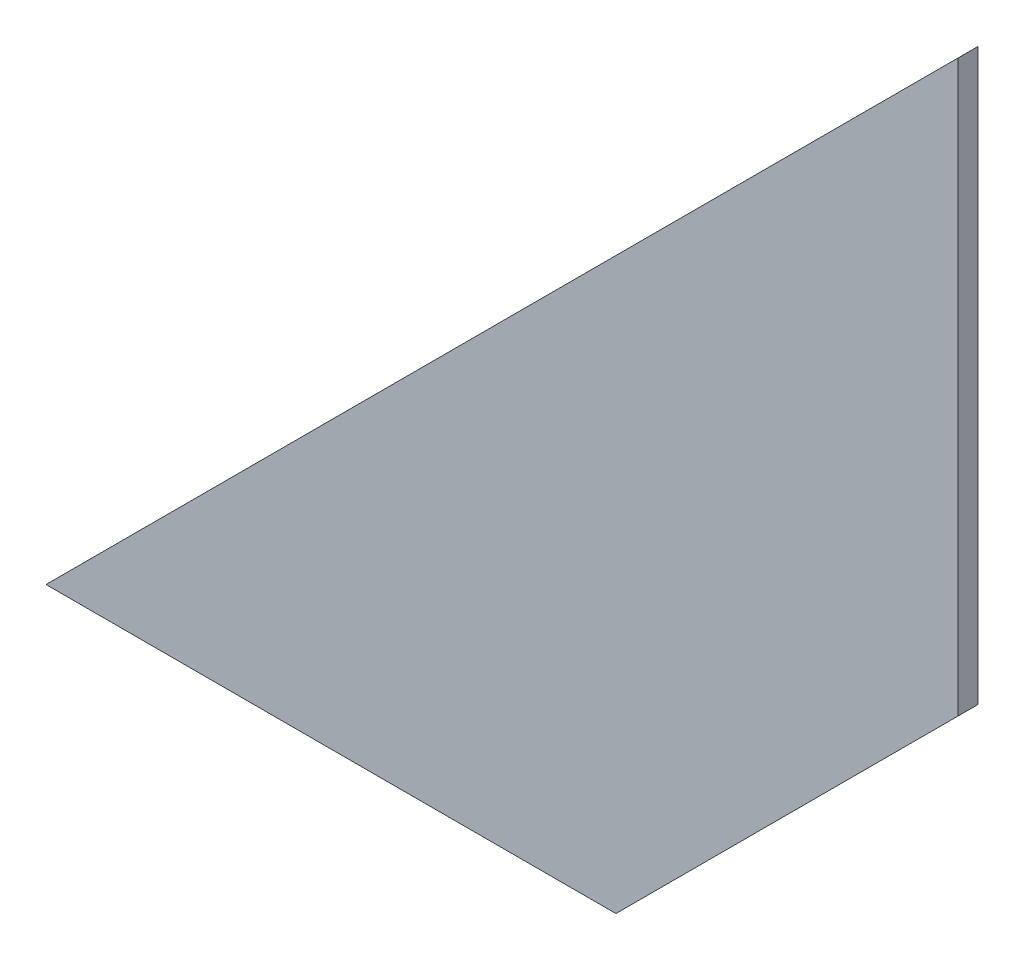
from build123d import *

# Parameters (mm, degrees)
BOSS_EXTRU_1_DEPTH = 10


with BuildPart() as part:
    # Esquisse1 → Boss.-Extru.1 (new body)
    with BuildSketch(Plane.XY):
        Polygon((0, 0), (282.842712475, 0), (452.548339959, 169.705627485), (452.548339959, 452.548339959), align=None)
    extrude(amount=BOSS_EXTRU_1_DEPTH)


solid = part.part
